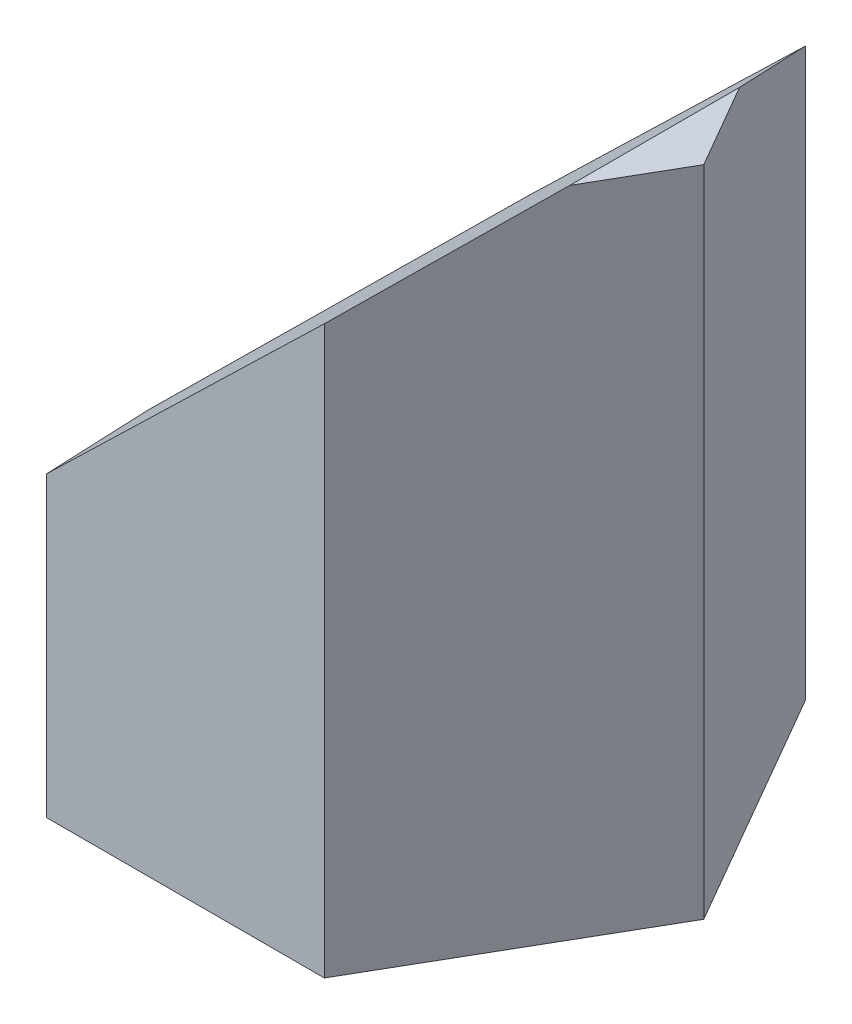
ISO-10303-21;
HEADER;
FILE_DESCRIPTION(('STEP AP214'),'2;1');
FILE_NAME('part.step','',(''),(''),'','','');
FILE_SCHEMA(('AUTOMOTIVE_DESIGN { 1 0 10303 214 1 1 1 1 }'));
ENDSEC;
DATA;
#1=APPLICATION_CONTEXT('core data for automotive mechanical design processes');
#2=APPLICATION_PROTOCOL_DEFINITION('international standard','automotive_design',2000,#1);
#3=PRODUCT_CONTEXT('',#1,'mechanical');
#4=PRODUCT('Part','Part','',(#3));
#5=PRODUCT_RELATED_PRODUCT_CATEGORY('part','',(#4));
#6=PRODUCT_DEFINITION_FORMATION('','',#4);
#7=PRODUCT_DEFINITION_CONTEXT('part definition',#1,'design');
#8=PRODUCT_DEFINITION('design','',#6,#7);
#9=PRODUCT_DEFINITION_SHAPE('','',#8);
#10=(LENGTH_UNIT() NAMED_UNIT(*) SI_UNIT(.MILLI.,.METRE.));
#11=(NAMED_UNIT(*) PLANE_ANGLE_UNIT() SI_UNIT($,.RADIAN.));
#12=(NAMED_UNIT(*) SI_UNIT($,.STERADIAN.) SOLID_ANGLE_UNIT());
#13=UNCERTAINTY_MEASURE_WITH_UNIT(LENGTH_MEASURE(1.E-05),#10,'distance_accuracy_value','');
#14=(GEOMETRIC_REPRESENTATION_CONTEXT(3) GLOBAL_UNCERTAINTY_ASSIGNED_CONTEXT((#13)) GLOBAL_UNIT_ASSIGNED_CONTEXT((#10,
#11,#12)) REPRESENTATION_CONTEXT('',''));
#15=CARTESIAN_POINT('',(0.,0.,0.));
#16=DIRECTION('',(0.,0.,1.));
#17=DIRECTION('',(1.,0.,0.));
#18=AXIS2_PLACEMENT_3D('',#15,#16,#17);
#19=CARTESIAN_POINT('',(8.50000000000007,40.,14.7224318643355));
#20=DIRECTION('',(-0.866025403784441,0.,-0.499999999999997));
#21=DIRECTION('',(-0.499999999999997,0.,0.866025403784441));
#22=AXIS2_PLACEMENT_3D('',#19,#20,#21);
#23=PLANE('',#22);
#24=DIRECTION('',(0.499999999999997,0.,-0.866025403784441));
#25=VECTOR('',#24,1.);
#26=CARTESIAN_POINT('',(8.50000000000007,40.,14.7224318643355));
#27=LINE('',#26,#25);
#28=CARTESIAN_POINT('',(14.,40.,5.19615242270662));
#29=VERTEX_POINT('',#28);
#30=CARTESIAN_POINT('',(17.,40.,0.));
#31=VERTEX_POINT('',#30);
#32=EDGE_CURVE('E56',#29,#31,#27,.T.);
#33=ORIENTED_EDGE('',*,*,#32,.F.);
#34=DIRECTION('',(-0.450079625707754,-0.435560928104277,0.779560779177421));
#35=VECTOR('',#34,1.);
#36=CARTESIAN_POINT('',(9.54342327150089,35.6871838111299,12.9151697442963));
#37=LINE('',#36,#35);
#38=CARTESIAN_POINT('',(8.50000000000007,34.6774193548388,14.7224318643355));
#39=VERTEX_POINT('',#38);
#40=EDGE_CURVE('E48',#29,#39,#37,.T.);
#41=ORIENTED_EDGE('',*,*,#40,.T.);
#42=DIRECTION('',(0.,-1.,0.));
#43=VECTOR('',#42,1.);
#44=CARTESIAN_POINT('',(8.50000000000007,40.,14.7224318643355));
#45=LINE('',#44,#43);
#46=CARTESIAN_POINT('',(8.50000000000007,0.,14.7224318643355));
#47=VERTEX_POINT('',#46);
#48=EDGE_CURVE('E93',#39,#47,#45,.T.);
#49=ORIENTED_EDGE('',*,*,#48,.T.);
#50=DIRECTION('',(0.499999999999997,0.,-0.866025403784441));
#51=VECTOR('',#50,1.);
#52=CARTESIAN_POINT('',(8.50000000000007,0.,14.7224318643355));
#53=LINE('',#52,#51);
#54=CARTESIAN_POINT('',(17.,0.,0.));
#55=VERTEX_POINT('',#54);
#56=EDGE_CURVE('E106',#47,#55,#53,.T.);
#57=ORIENTED_EDGE('',*,*,#56,.T.);
#58=DIRECTION('',(0.,-1.,0.));
#59=VECTOR('',#58,1.);
#60=CARTESIAN_POINT('',(17.,40.,0.));
#61=LINE('',#60,#59);
#62=EDGE_CURVE('E42',#31,#55,#61,.T.);
#63=ORIENTED_EDGE('',*,*,#62,.F.);
#64=EDGE_LOOP('',(#33,#41,#49,#57,#63));
#65=FACE_BOUND('',#64,.T.);
#66=ADVANCED_FACE('F35',(#65),#23,.F.);
#67=CARTESIAN_POINT('',(17.,40.,0.));
#68=DIRECTION('',(-0.866025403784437,0.,0.500000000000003));
#69=DIRECTION('',(0.500000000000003,0.,0.866025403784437));
#70=AXIS2_PLACEMENT_3D('',#67,#68,#69);
#71=PLANE('',#70);
#72=DIRECTION('',(0.,-1.,0.));
#73=VECTOR('',#72,1.);
#74=CARTESIAN_POINT('',(8.49999999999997,40.,-14.7224318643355));
#75=LINE('',#74,#73);
#76=CARTESIAN_POINT('',(8.49999999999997,34.6774193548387,-14.7224318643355));
#77=VERTEX_POINT('',#76);
#78=CARTESIAN_POINT('',(8.49999999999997,0.,-14.7224318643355));
#79=VERTEX_POINT('',#78);
#80=EDGE_CURVE('E116',#77,#79,#75,.T.);
#81=ORIENTED_EDGE('',*,*,#80,.F.);
#82=DIRECTION('',(0.450079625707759,0.435560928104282,0.779560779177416));
#83=VECTOR('',#82,1.);
#84=CARTESIAN_POINT('',(16.4308600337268,42.3524451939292,-0.98577933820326));
#85=LINE('',#84,#83);
#86=CARTESIAN_POINT('',(14.,40.,-5.19615242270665));
#87=VERTEX_POINT('',#86);
#88=EDGE_CURVE('E130',#77,#87,#85,.T.);
#89=ORIENTED_EDGE('',*,*,#88,.T.);
#90=DIRECTION('',(-0.500000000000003,0.,-0.866025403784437));
#91=VECTOR('',#90,1.);
#92=CARTESIAN_POINT('',(17.,40.,0.));
#93=LINE('',#92,#91);
#94=EDGE_CURVE('E108',#31,#87,#93,.T.);
#95=ORIENTED_EDGE('',*,*,#94,.F.);
#96=ORIENTED_EDGE('',*,*,#62,.T.);
#97=DIRECTION('',(-0.500000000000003,0.,-0.866025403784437));
#98=VECTOR('',#97,1.);
#99=CARTESIAN_POINT('',(17.,0.,0.));
#100=LINE('',#99,#98);
#101=EDGE_CURVE('E123',#55,#79,#100,.T.);
#102=ORIENTED_EDGE('',*,*,#101,.T.);
#103=EDGE_LOOP('',(#81,#89,#95,#96,#102));
#104=FACE_BOUND('',#103,.T.);
#105=ADVANCED_FACE('F122',(#104),#71,.F.);
#106=CARTESIAN_POINT('',(8.49999999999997,40.,-14.7224318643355));
#107=DIRECTION('',(0.,0.,1.));
#108=DIRECTION('',(1.,0.,0.));
#109=AXIS2_PLACEMENT_3D('',#106,#107,#108);
#110=PLANE('',#109);
#111=DIRECTION('',(0.,-1.,0.));
#112=VECTOR('',#111,1.);
#113=CARTESIAN_POINT('',(-8.50000000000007,40.,-14.7224318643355));
#114=LINE('',#113,#112);
#115=CARTESIAN_POINT('',(-8.50000000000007,18.2258064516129,-14.7224318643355));
#116=VERTEX_POINT('',#115);
#117=CARTESIAN_POINT('',(-8.50000000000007,0.,-14.7224318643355));
#118=VERTEX_POINT('',#117);
#119=EDGE_CURVE('E114',#116,#118,#114,.T.);
#120=ORIENTED_EDGE('',*,*,#119,.F.);
#121=DIRECTION('',(0.718602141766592,0.695421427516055,0.));
#122=VECTOR('',#121,1.);
#123=CARTESIAN_POINT('',(11.1598602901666,37.2514777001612,-14.7224318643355));
#124=LINE('',#123,#122);
#125=EDGE_CURVE('E145',#116,#77,#124,.T.);
#126=ORIENTED_EDGE('',*,*,#125,.T.);
#127=ORIENTED_EDGE('',*,*,#80,.T.);
#128=DIRECTION('',(-1.,0.,0.));
#129=VECTOR('',#128,1.);
#130=CARTESIAN_POINT('',(8.49999999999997,0.,-14.7224318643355));
#131=LINE('',#130,#129);
#132=EDGE_CURVE('E128',#79,#118,#131,.T.);
#133=ORIENTED_EDGE('',*,*,#132,.T.);
#134=EDGE_LOOP('',(#120,#126,#127,#133));
#135=FACE_BOUND('',#134,.T.);
#136=ADVANCED_FACE('F141',(#135),#110,.F.);
#137=CARTESIAN_POINT('',(-8.50000000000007,40.,-14.7224318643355));
#138=DIRECTION('',(0.866025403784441,0.,0.499999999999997));
#139=DIRECTION('',(0.499999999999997,0.,-0.866025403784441));
#140=AXIS2_PLACEMENT_3D('',#137,#138,#139);
#141=PLANE('',#140);
#142=DIRECTION('',(0.,-1.,0.));
#143=VECTOR('',#142,1.);
#144=CARTESIAN_POINT('',(-17.,40.,0.));
#145=LINE('',#144,#143);
#146=CARTESIAN_POINT('',(-17.,10.,0.));
#147=VERTEX_POINT('',#146);
#148=CARTESIAN_POINT('',(-17.,0.,0.));
#149=VERTEX_POINT('',#148);
#150=EDGE_CURVE('E92',#147,#149,#145,.T.);
#151=ORIENTED_EDGE('',*,*,#150,.F.);
#152=DIRECTION('',(0.450079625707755,0.435560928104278,-0.779560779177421));
#153=VECTOR('',#152,1.);
#154=CARTESIAN_POINT('',(-4.23145025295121,22.3566610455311,-22.1157769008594));
#155=LINE('',#154,#153);
#156=EDGE_CURVE('E155',#147,#116,#155,.T.);
#157=ORIENTED_EDGE('',*,*,#156,.T.);
#158=ORIENTED_EDGE('',*,*,#119,.T.);
#159=DIRECTION('',(-0.499999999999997,0.,0.86602540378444));
#160=VECTOR('',#159,1.);
#161=CARTESIAN_POINT('',(-8.50000000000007,0.,-14.7224318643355));
#162=LINE('',#161,#160);
#163=EDGE_CURVE('E102',#118,#149,#162,.T.);
#164=ORIENTED_EDGE('',*,*,#163,.T.);
#165=EDGE_LOOP('',(#151,#157,#158,#164));
#166=FACE_BOUND('',#165,.T.);
#167=ADVANCED_FACE('F136',(#166),#141,.F.);
#168=CARTESIAN_POINT('',(-17.,40.,0.));
#169=DIRECTION('',(0.866025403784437,0.,-0.500000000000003));
#170=DIRECTION('',(-0.500000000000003,0.,-0.866025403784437));
#171=AXIS2_PLACEMENT_3D('',#168,#169,#170);
#172=PLANE('',#171);
#173=DIRECTION('',(0.,-1.,0.));
#174=VECTOR('',#173,1.);
#175=CARTESIAN_POINT('',(-8.49999999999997,40.,14.7224318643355));
#176=LINE('',#175,#174);
#177=CARTESIAN_POINT('',(-8.49999999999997,18.225806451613,14.7224318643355));
#178=VERTEX_POINT('',#177);
#179=CARTESIAN_POINT('',(-8.49999999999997,0.,14.7224318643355));
#180=VERTEX_POINT('',#179);
#181=EDGE_CURVE('E81',#178,#180,#176,.T.);
#182=ORIENTED_EDGE('',*,*,#181,.F.);
#183=DIRECTION('',(-0.450079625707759,-0.435560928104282,-0.779560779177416));
#184=VECTOR('',#183,1.);
#185=CARTESIAN_POINT('',(-11.1188870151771,15.6913996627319,10.1863864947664));
#186=LINE('',#185,#184);
#187=EDGE_CURVE('E157',#178,#147,#186,.T.);
#188=ORIENTED_EDGE('',*,*,#187,.T.);
#189=ORIENTED_EDGE('',*,*,#150,.T.);
#190=DIRECTION('',(0.500000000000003,0.,0.866025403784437));
#191=VECTOR('',#190,1.);
#192=CARTESIAN_POINT('',(-17.,0.,0.));
#193=LINE('',#192,#191);
#194=EDGE_CURVE('E96',#149,#180,#193,.T.);
#195=ORIENTED_EDGE('',*,*,#194,.T.);
#196=EDGE_LOOP('',(#182,#188,#189,#195));
#197=FACE_BOUND('',#196,.T.);
#198=ADVANCED_FACE('F97',(#197),#172,.F.);
#199=CARTESIAN_POINT('',(-8.49999999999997,40.,14.7224318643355));
#200=DIRECTION('',(0.,0.,-1.));
#201=DIRECTION('',(-1.,0.,0.));
#202=AXIS2_PLACEMENT_3D('',#199,#200,#201);
#203=PLANE('',#202);
#204=ORIENTED_EDGE('',*,*,#48,.F.);
#205=DIRECTION('',(-0.718602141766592,-0.695421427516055,0.));
#206=VECTOR('',#205,1.);
#207=CARTESIAN_POINT('',(2.38124664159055,28.7560451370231,14.7224318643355));
#208=LINE('',#207,#206);
#209=EDGE_CURVE('E89',#39,#178,#208,.T.);
#210=ORIENTED_EDGE('',*,*,#209,.T.);
#211=ORIENTED_EDGE('',*,*,#181,.T.);
#212=DIRECTION('',(1.,0.,0.));
#213=VECTOR('',#212,1.);
#214=CARTESIAN_POINT('',(-8.49999999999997,0.,14.7224318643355));
#215=LINE('',#214,#213);
#216=EDGE_CURVE('E86',#180,#47,#215,.T.);
#217=ORIENTED_EDGE('',*,*,#216,.T.);
#218=EDGE_LOOP('',(#204,#210,#211,#217));
#219=FACE_BOUND('',#218,.T.);
#220=ADVANCED_FACE('F84',(#219),#203,.F.);
#221=CARTESIAN_POINT('',(0.,40.,0.));
#222=DIRECTION('',(0.,1.,0.));
#223=DIRECTION('',(0.,0.,1.));
#224=AXIS2_PLACEMENT_3D('',#221,#222,#223);
#225=PLANE('',#224);
#226=DIRECTION('',(0.,0.,-1.));
#227=VECTOR('',#226,1.);
#228=CARTESIAN_POINT('',(14.,40.,0.));
#229=LINE('',#228,#227);
#230=EDGE_CURVE('E11',#29,#87,#229,.T.);
#231=ORIENTED_EDGE('',*,*,#230,.F.);
#232=ORIENTED_EDGE('',*,*,#32,.T.);
#233=ORIENTED_EDGE('',*,*,#94,.T.);
#234=EDGE_LOOP('',(#231,#232,#233));
#235=FACE_BOUND('',#234,.T.);
#236=ADVANCED_FACE('F168',(#235),#225,.T.);
#237=CARTESIAN_POINT('',(0.,0.,0.));
#238=DIRECTION('',(0.,1.,0.));
#239=DIRECTION('',(0.,0.,1.));
#240=AXIS2_PLACEMENT_3D('',#237,#238,#239);
#241=PLANE('',#240);
#242=ORIENTED_EDGE('',*,*,#56,.F.);
#243=ORIENTED_EDGE('',*,*,#216,.F.);
#244=ORIENTED_EDGE('',*,*,#194,.F.);
#245=ORIENTED_EDGE('',*,*,#163,.F.);
#246=ORIENTED_EDGE('',*,*,#132,.F.);
#247=ORIENTED_EDGE('',*,*,#101,.F.);
#248=EDGE_LOOP('',(#242,#243,#244,#245,#246,#247));
#249=FACE_BOUND('',#248,.T.);
#250=ADVANCED_FACE('F104',(#249),#241,.F.);
#251=CARTESIAN_POINT('',(14.,40.,-20.));
#252=DIRECTION('',(0.695421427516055,-0.718602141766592,0.));
#253=DIRECTION('',(0.718602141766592,0.695421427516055,0.));
#254=AXIS2_PLACEMENT_3D('',#251,#252,#253);
#255=PLANE('',#254);
#256=ORIENTED_EDGE('',*,*,#230,.T.);
#257=ORIENTED_EDGE('',*,*,#88,.F.);
#258=ORIENTED_EDGE('',*,*,#125,.F.);
#259=ORIENTED_EDGE('',*,*,#156,.F.);
#260=ORIENTED_EDGE('',*,*,#187,.F.);
#261=ORIENTED_EDGE('',*,*,#209,.F.);
#262=ORIENTED_EDGE('',*,*,#40,.F.);
#263=EDGE_LOOP('',(#256,#257,#258,#259,#260,#261,#262));
#264=FACE_BOUND('',#263,.T.);
#265=ADVANCED_FACE('F156',(#264),#255,.F.);
#266=CLOSED_SHELL('',(#66,#105,#136,#167,#198,#220,#236,#250,#265));
#267=MANIFOLD_SOLID_BREP('B2',#266);
#268=ADVANCED_BREP_SHAPE_REPRESENTATION('',(#18,#267),#14);
#269=SHAPE_DEFINITION_REPRESENTATION(#9,#268);
ENDSEC;
END-ISO-10303-21;
